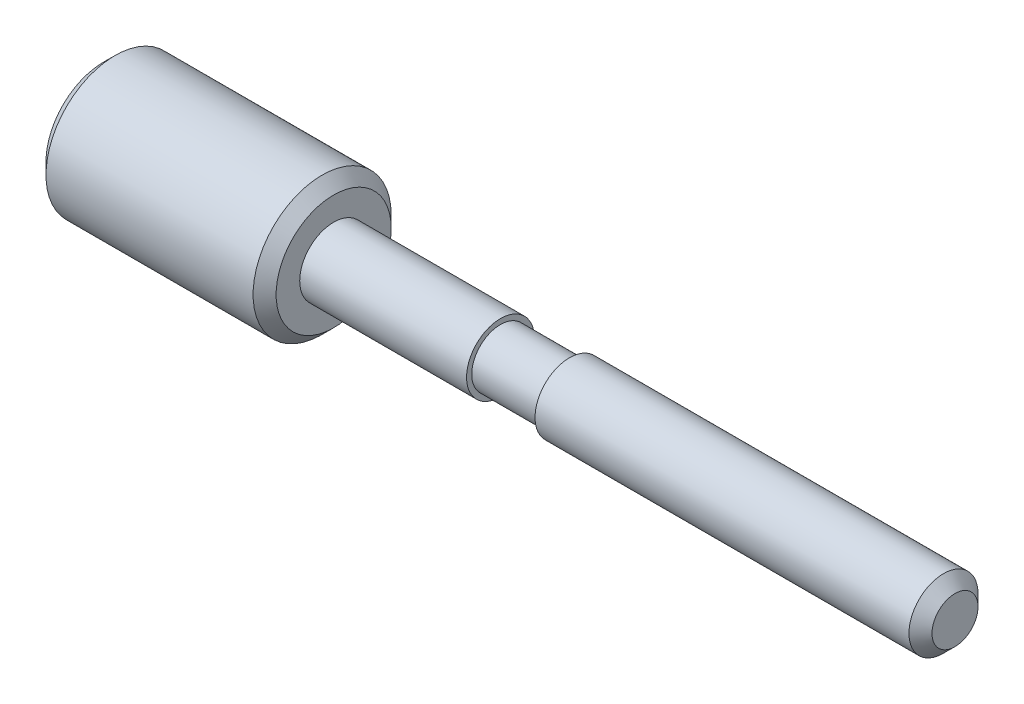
ISO-10303-21;
HEADER;
FILE_DESCRIPTION(('STEP AP214'),'2;1');
FILE_NAME('part.step','',(''),(''),'','','');
FILE_SCHEMA(('AUTOMOTIVE_DESIGN { 1 0 10303 214 1 1 1 1 }'));
ENDSEC;
DATA;
#1=APPLICATION_CONTEXT('core data for automotive mechanical design processes');
#2=APPLICATION_PROTOCOL_DEFINITION('international standard','automotive_design',2000,#1);
#3=PRODUCT_CONTEXT('',#1,'mechanical');
#4=PRODUCT('Part','Part','',(#3));
#5=PRODUCT_RELATED_PRODUCT_CATEGORY('part','',(#4));
#6=PRODUCT_DEFINITION_FORMATION('','',#4);
#7=PRODUCT_DEFINITION_CONTEXT('part definition',#1,'design');
#8=PRODUCT_DEFINITION('design','',#6,#7);
#9=PRODUCT_DEFINITION_SHAPE('','',#8);
#10=(LENGTH_UNIT() NAMED_UNIT(*) SI_UNIT(.MILLI.,.METRE.));
#11=(NAMED_UNIT(*) PLANE_ANGLE_UNIT() SI_UNIT($,.RADIAN.));
#12=(NAMED_UNIT(*) SI_UNIT($,.STERADIAN.) SOLID_ANGLE_UNIT());
#13=UNCERTAINTY_MEASURE_WITH_UNIT(LENGTH_MEASURE(1.E-05),#10,'distance_accuracy_value','');
#14=(GEOMETRIC_REPRESENTATION_CONTEXT(3) GLOBAL_UNCERTAINTY_ASSIGNED_CONTEXT((#13)) GLOBAL_UNIT_ASSIGNED_CONTEXT((#10,
#11,#12)) REPRESENTATION_CONTEXT('',''));
#15=CARTESIAN_POINT('',(0.,0.,0.));
#16=DIRECTION('',(0.,0.,1.));
#17=DIRECTION('',(1.,0.,0.));
#18=AXIS2_PLACEMENT_3D('',#15,#16,#17);
#19=CARTESIAN_POINT('',(34.5,0.,0.));
#20=DIRECTION('',(1.,0.,0.));
#21=DIRECTION('',(0.,0.,-1.));
#22=AXIS2_PLACEMENT_3D('',#19,#20,#21);
#23=PLANE('',#22);
#24=CARTESIAN_POINT('',(34.5,0.,0.));
#25=DIRECTION('',(1.,0.,0.));
#26=DIRECTION('',(0.,0.,-1.));
#27=AXIS2_PLACEMENT_3D('',#24,#25,#26);
#28=CIRCLE('',#27,2.95);
#29=CARTESIAN_POINT('',(34.5,0.,2.95));
#30=VERTEX_POINT('',#29);
#31=EDGE_CURVE('E53',#30,#30,#28,.T.);
#32=ORIENTED_EDGE('',*,*,#31,.T.);
#33=EDGE_LOOP('',(#32));
#34=FACE_BOUND('',#33,.T.);
#35=CARTESIAN_POINT('',(34.5,0.,0.));
#36=DIRECTION('',(1.,0.,0.));
#37=DIRECTION('',(0.,0.,-1.));
#38=AXIS2_PLACEMENT_3D('',#35,#36,#37);
#39=CIRCLE('',#38,2.5);
#40=CARTESIAN_POINT('',(34.5,0.,-2.5));
#41=VERTEX_POINT('',#40);
#42=EDGE_CURVE('E62',#41,#41,#39,.T.);
#43=ORIENTED_EDGE('',*,*,#42,.F.);
#44=EDGE_LOOP('',(#43));
#45=FACE_BOUND('',#44,.T.);
#46=ADVANCED_FACE('F27',(#34,#45),#23,.T.);
#47=CARTESIAN_POINT('',(20.,0.,0.));
#48=DIRECTION('',(1.,0.,0.));
#49=DIRECTION('',(0.,0.,-1.));
#50=AXIS2_PLACEMENT_3D('',#47,#48,#49);
#51=PLANE('',#50);
#52=CARTESIAN_POINT('',(20.,0.,0.));
#53=DIRECTION('',(1.,0.,0.));
#54=DIRECTION('',(0.,0.,-1.));
#55=AXIS2_PLACEMENT_3D('',#52,#53,#54);
#56=CIRCLE('',#55,4.99999999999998);
#57=CARTESIAN_POINT('',(20.,0.,-4.99999999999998));
#58=VERTEX_POINT('',#57);
#59=EDGE_CURVE('E38',#58,#58,#56,.T.);
#60=ORIENTED_EDGE('',*,*,#59,.T.);
#61=EDGE_LOOP('',(#60));
#62=FACE_BOUND('',#61,.T.);
#63=CARTESIAN_POINT('',(20.,0.,0.));
#64=DIRECTION('',(1.,0.,0.));
#65=DIRECTION('',(0.,0.,-1.));
#66=AXIS2_PLACEMENT_3D('',#63,#64,#65);
#67=CIRCLE('',#66,2.95);
#68=CARTESIAN_POINT('',(20.,0.,2.95));
#69=VERTEX_POINT('',#68);
#70=EDGE_CURVE('E56',#69,#69,#67,.T.);
#71=ORIENTED_EDGE('',*,*,#70,.F.);
#72=EDGE_LOOP('',(#71));
#73=FACE_BOUND('',#72,.T.);
#74=ADVANCED_FACE('F85',(#62,#73),#51,.T.);
#75=CARTESIAN_POINT('',(20.,0.,0.));
#76=DIRECTION('',(-1.,0.,0.));
#77=DIRECTION('',(0.,0.,1.));
#78=AXIS2_PLACEMENT_3D('',#75,#76,#77);
#79=CYLINDRICAL_SURFACE('',#78,6.);
#80=CARTESIAN_POINT('',(1.,0.,0.));
#81=DIRECTION('',(1.,0.,0.));
#82=DIRECTION('',(0.,0.,-1.));
#83=AXIS2_PLACEMENT_3D('',#80,#81,#82);
#84=CIRCLE('',#83,6.);
#85=CARTESIAN_POINT('',(1.,0.,-6.));
#86=VERTEX_POINT('',#85);
#87=EDGE_CURVE('E47',#86,#86,#84,.T.);
#88=ORIENTED_EDGE('',*,*,#87,.T.);
#89=EDGE_LOOP('',(#88));
#90=FACE_BOUND('',#89,.T.);
#91=CARTESIAN_POINT('',(19.,0.,0.));
#92=DIRECTION('',(1.,0.,0.));
#93=DIRECTION('',(0.,0.,-1.));
#94=AXIS2_PLACEMENT_3D('',#91,#92,#93);
#95=CIRCLE('',#94,6.);
#96=CARTESIAN_POINT('',(19.,0.,-6.));
#97=VERTEX_POINT('',#96);
#98=EDGE_CURVE('E50',#97,#97,#95,.F.);
#99=ORIENTED_EDGE('',*,*,#98,.T.);
#100=EDGE_LOOP('',(#99));
#101=FACE_BOUND('',#100,.T.);
#102=ADVANCED_FACE('F29',(#90,#101),#79,.T.);
#103=CARTESIAN_POINT('',(0.,0.,0.));
#104=DIRECTION('',(1.,0.,0.));
#105=DIRECTION('',(0.,0.,-1.));
#106=AXIS2_PLACEMENT_3D('',#103,#104,#105);
#107=PLANE('',#106);
#108=CARTESIAN_POINT('',(0.,0.,0.));
#109=DIRECTION('',(1.,0.,0.));
#110=DIRECTION('',(0.,0.,-1.));
#111=AXIS2_PLACEMENT_3D('',#108,#109,#110);
#112=CIRCLE('',#111,5.);
#113=CARTESIAN_POINT('',(0.,0.,-5.));
#114=VERTEX_POINT('',#113);
#115=EDGE_CURVE('E42',#114,#114,#112,.F.);
#116=ORIENTED_EDGE('',*,*,#115,.T.);
#117=EDGE_LOOP('',(#116));
#118=FACE_BOUND('',#117,.T.);
#119=ADVANCED_FACE('F96',(#118),#107,.F.);
#120=CARTESIAN_POINT('',(34.5,0.,0.));
#121=DIRECTION('',(-1.,0.,0.));
#122=DIRECTION('',(0.,0.,1.));
#123=AXIS2_PLACEMENT_3D('',#120,#121,#122);
#124=CYLINDRICAL_SURFACE('',#123,2.95);
#125=CARTESIAN_POINT('',(34.5,0.,2.95));
#126=CARTESIAN_POINT('',(34.3489583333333,0.,2.95));
#127=CARTESIAN_POINT('',(34.1979166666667,0.,2.95));
#128=CARTESIAN_POINT('',(33.8958333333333,0.,2.95));
#129=CARTESIAN_POINT('',(33.7447916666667,0.,2.95));
#130=CARTESIAN_POINT('',(33.4427083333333,0.,2.95));
#131=CARTESIAN_POINT('',(33.2916666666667,0.,2.95));
#132=CARTESIAN_POINT('',(32.9895833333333,0.,2.95));
#133=CARTESIAN_POINT('',(32.8385416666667,0.,2.95));
#134=CARTESIAN_POINT('',(32.5364583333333,0.,2.95));
#135=CARTESIAN_POINT('',(32.3854166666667,0.,2.95));
#136=CARTESIAN_POINT('',(32.0833333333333,0.,2.95));
#137=CARTESIAN_POINT('',(31.9322916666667,0.,2.95));
#138=CARTESIAN_POINT('',(31.6302083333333,0.,2.95));
#139=CARTESIAN_POINT('',(31.4791666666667,0.,2.95));
#140=CARTESIAN_POINT('',(31.1770833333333,0.,2.95));
#141=CARTESIAN_POINT('',(31.0260416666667,0.,2.95));
#142=CARTESIAN_POINT('',(30.7239583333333,0.,2.95));
#143=CARTESIAN_POINT('',(30.5729166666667,0.,2.95));
#144=CARTESIAN_POINT('',(30.2708333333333,0.,2.95));
#145=CARTESIAN_POINT('',(30.1197916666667,0.,2.95));
#146=CARTESIAN_POINT('',(29.8177083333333,0.,2.95));
#147=CARTESIAN_POINT('',(29.6666666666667,0.,2.95));
#148=CARTESIAN_POINT('',(29.3645833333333,0.,2.95));
#149=CARTESIAN_POINT('',(29.2135416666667,0.,2.95));
#150=CARTESIAN_POINT('',(28.9114583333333,0.,2.95));
#151=CARTESIAN_POINT('',(28.7604166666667,0.,2.95));
#152=CARTESIAN_POINT('',(28.4583333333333,0.,2.95));
#153=CARTESIAN_POINT('',(28.3072916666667,0.,2.95));
#154=CARTESIAN_POINT('',(28.0052083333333,0.,2.95));
#155=CARTESIAN_POINT('',(27.8541666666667,0.,2.95));
#156=CARTESIAN_POINT('',(27.5520833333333,0.,2.95));
#157=CARTESIAN_POINT('',(27.4010416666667,0.,2.95));
#158=CARTESIAN_POINT('',(27.0989583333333,0.,2.95));
#159=CARTESIAN_POINT('',(26.9479166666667,0.,2.95));
#160=CARTESIAN_POINT('',(26.6458333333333,0.,2.95));
#161=CARTESIAN_POINT('',(26.4947916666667,0.,2.95));
#162=CARTESIAN_POINT('',(26.1927083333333,0.,2.95));
#163=CARTESIAN_POINT('',(26.0416666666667,0.,2.95));
#164=CARTESIAN_POINT('',(25.7395833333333,0.,2.95));
#165=CARTESIAN_POINT('',(25.5885416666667,0.,2.95));
#166=CARTESIAN_POINT('',(25.2864583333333,0.,2.95));
#167=CARTESIAN_POINT('',(25.1354166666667,0.,2.95));
#168=CARTESIAN_POINT('',(24.8333333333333,0.,2.95));
#169=CARTESIAN_POINT('',(24.6822916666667,0.,2.95));
#170=CARTESIAN_POINT('',(24.3802083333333,0.,2.95));
#171=CARTESIAN_POINT('',(24.2291666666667,0.,2.95));
#172=CARTESIAN_POINT('',(23.9270833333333,0.,2.95));
#173=CARTESIAN_POINT('',(23.7760416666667,0.,2.95));
#174=CARTESIAN_POINT('',(23.4739583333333,0.,2.95));
#175=CARTESIAN_POINT('',(23.3229166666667,0.,2.95));
#176=CARTESIAN_POINT('',(23.0208333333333,0.,2.95));
#177=CARTESIAN_POINT('',(22.8697916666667,0.,2.95));
#178=CARTESIAN_POINT('',(22.5677083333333,0.,2.95));
#179=CARTESIAN_POINT('',(22.4166666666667,0.,2.95));
#180=CARTESIAN_POINT('',(22.1145833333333,0.,2.95));
#181=CARTESIAN_POINT('',(21.9635416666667,0.,2.95));
#182=CARTESIAN_POINT('',(21.6614583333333,0.,2.95));
#183=CARTESIAN_POINT('',(21.5104166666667,0.,2.95));
#184=CARTESIAN_POINT('',(21.2083333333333,0.,2.95));
#185=CARTESIAN_POINT('',(21.0572916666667,0.,2.95));
#186=CARTESIAN_POINT('',(20.7552083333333,0.,2.95));
#187=CARTESIAN_POINT('',(20.6041666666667,0.,2.95));
#188=CARTESIAN_POINT('',(20.3020833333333,0.,2.95));
#189=CARTESIAN_POINT('',(20.1510416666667,0.,2.95));
#190=CARTESIAN_POINT('',(20.,0.,2.95));
#191=B_SPLINE_CURVE_WITH_KNOTS('',3,(#125,#126,#127,#128,#129,#130,#131,#132,#133,#134,#135,
#136,#137,#138,#139,#140,#141,#142,#143,#144,#145,#146,#147,#148,#149,#150,#151,#152,#153,#154,
#155,#156,#157,#158,#159,#160,#161,#162,#163,#164,#165,#166,#167,#168,#169,#170,#171,#172,#173,
#174,#175,#176,#177,#178,#179,#180,#181,#182,#183,#184,#185,#186,#187,#188,#189,#190),
.UNSPECIFIED.,.F.,.F.,(4,2,2,2,2,2,2,2,2,2,2,2,2,2,2,2,2,2,2,2,2,2,2,2,2,2,2,2,2,2,2,2,4),(0.,
0.453124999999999,0.906249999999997,1.359375,1.81249999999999,2.26562499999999,2.71875,3.171875,
3.625,4.07812499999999,4.53125,4.984375,5.4375,5.890625,6.34375,6.796875,7.25,7.703125,8.15625,
8.60937499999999,9.06249999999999,9.515625,9.96875,10.421875,10.875,11.328125,11.78125,
12.234375,12.6875,13.140625,13.59375,14.046875,14.5),.UNSPECIFIED.);
#192=EDGE_CURVE('BSEAM80',#30,#69,#191,.T.);
#193=ORIENTED_EDGE('',*,*,#31,.F.);
#194=ORIENTED_EDGE('',*,*,#70,.T.);
#195=ORIENTED_EDGE('',*,*,#192,.T.);
#196=ORIENTED_EDGE('',*,*,#192,.F.);
#197=EDGE_LOOP('',(#193,#195,#194,#196));
#198=FACE_BOUND('',#197,.T.);
#199=ADVANCED_FACE('F80',(#198),#124,.T.);
#200=CARTESIAN_POINT('',(40.5,0.,0.));
#201=DIRECTION('',(-1.,0.,0.));
#202=DIRECTION('',(0.,0.,1.));
#203=AXIS2_PLACEMENT_3D('',#200,#201,#202);
#204=CYLINDRICAL_SURFACE('',#203,2.5);
#205=CARTESIAN_POINT('',(40.5,0.,0.));
#206=DIRECTION('',(1.,0.,0.));
#207=DIRECTION('',(0.,0.,-1.));
#208=AXIS2_PLACEMENT_3D('',#205,#206,#207);
#209=CIRCLE('',#208,2.5);
#210=CARTESIAN_POINT('',(40.5,0.,-2.5));
#211=VERTEX_POINT('',#210);
#212=EDGE_CURVE('E59',#211,#211,#209,.T.);
#213=ORIENTED_EDGE('',*,*,#212,.F.);
#214=EDGE_LOOP('',(#213));
#215=FACE_BOUND('',#214,.T.);
#216=ORIENTED_EDGE('',*,*,#42,.T.);
#217=EDGE_LOOP('',(#216));
#218=FACE_BOUND('',#217,.T.);
#219=ADVANCED_FACE('F74',(#215,#218),#204,.T.);
#220=CARTESIAN_POINT('',(40.5,0.,0.));
#221=DIRECTION('',(1.,0.,0.));
#222=DIRECTION('',(0.,0.,-1.));
#223=AXIS2_PLACEMENT_3D('',#220,#221,#222);
#224=PLANE('',#223);
#225=CARTESIAN_POINT('',(40.5,0.,0.));
#226=DIRECTION('',(1.,0.,0.));
#227=DIRECTION('',(0.,0.,-1.));
#228=AXIS2_PLACEMENT_3D('',#225,#226,#227);
#229=CIRCLE('',#228,3.);
#230=CARTESIAN_POINT('',(40.5,0.,-3.));
#231=VERTEX_POINT('',#230);
#232=EDGE_CURVE('E65',#231,#231,#229,.T.);
#233=ORIENTED_EDGE('',*,*,#232,.F.);
#234=EDGE_LOOP('',(#233));
#235=FACE_BOUND('',#234,.T.);
#236=ORIENTED_EDGE('',*,*,#212,.T.);
#237=EDGE_LOOP('',(#236));
#238=FACE_BOUND('',#237,.T.);
#239=ADVANCED_FACE('F71',(#235,#238),#224,.F.);
#240=CARTESIAN_POINT('',(74.,0.,0.));
#241=DIRECTION('',(-1.,0.,0.));
#242=DIRECTION('',(0.,0.,1.));
#243=AXIS2_PLACEMENT_3D('',#240,#241,#242);
#244=CYLINDRICAL_SURFACE('',#243,3.);
#245=CARTESIAN_POINT('',(73.,0.,0.));
#246=DIRECTION('',(1.,0.,0.));
#247=DIRECTION('',(0.,0.,-1.));
#248=AXIS2_PLACEMENT_3D('',#245,#246,#247);
#249=CIRCLE('',#248,3.);
#250=CARTESIAN_POINT('',(73.,0.,-3.));
#251=VERTEX_POINT('',#250);
#252=EDGE_CURVE('E10',#251,#251,#249,.F.);
#253=ORIENTED_EDGE('',*,*,#252,.T.);
#254=EDGE_LOOP('',(#253));
#255=FACE_BOUND('',#254,.T.);
#256=ORIENTED_EDGE('',*,*,#232,.T.);
#257=EDGE_LOOP('',(#256));
#258=FACE_BOUND('',#257,.T.);
#259=ADVANCED_FACE('F69',(#255,#258),#244,.T.);
#260=CARTESIAN_POINT('',(74.,0.,0.));
#261=DIRECTION('',(1.,0.,0.));
#262=DIRECTION('',(0.,0.,-1.));
#263=AXIS2_PLACEMENT_3D('',#260,#261,#262);
#264=PLANE('',#263);
#265=CARTESIAN_POINT('',(74.,0.,0.));
#266=DIRECTION('',(1.,0.,0.));
#267=DIRECTION('',(0.,0.,-1.));
#268=AXIS2_PLACEMENT_3D('',#265,#266,#267);
#269=CIRCLE('',#268,1.99999999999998);
#270=CARTESIAN_POINT('',(74.,0.,-1.99999999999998));
#271=VERTEX_POINT('',#270);
#272=EDGE_CURVE('E34',#271,#271,#269,.T.);
#273=ORIENTED_EDGE('',*,*,#272,.T.);
#274=EDGE_LOOP('',(#273));
#275=FACE_BOUND('',#274,.T.);
#276=ADVANCED_FACE('F110',(#275),#264,.T.);
#277=CARTESIAN_POINT('',(1.,0.,0.));
#278=DIRECTION('',(1.,0.,0.));
#279=DIRECTION('',(0.,0.,-1.));
#280=AXIS2_PLACEMENT_3D('',#277,#278,#279);
#281=CONICAL_SURFACE('',#280,6.,0.78539816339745);
#282=ORIENTED_EDGE('',*,*,#115,.F.);
#283=EDGE_LOOP('',(#282));
#284=FACE_BOUND('',#283,.T.);
#285=ORIENTED_EDGE('',*,*,#87,.F.);
#286=EDGE_LOOP('',(#285));
#287=FACE_BOUND('',#286,.T.);
#288=ADVANCED_FACE('F106',(#284,#287),#281,.T.);
#289=CARTESIAN_POINT('',(20.,0.,0.));
#290=DIRECTION('',(-1.,0.,0.));
#291=DIRECTION('',(0.,0.,1.));
#292=AXIS2_PLACEMENT_3D('',#289,#290,#291);
#293=CONICAL_SURFACE('',#292,4.99999999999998,0.785398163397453);
#294=ORIENTED_EDGE('',*,*,#98,.F.);
#295=EDGE_LOOP('',(#294));
#296=FACE_BOUND('',#295,.T.);
#297=ORIENTED_EDGE('',*,*,#59,.F.);
#298=EDGE_LOOP('',(#297));
#299=FACE_BOUND('',#298,.T.);
#300=ADVANCED_FACE('F109',(#296,#299),#293,.T.);
#301=CARTESIAN_POINT('',(74.,0.,0.));
#302=DIRECTION('',(-1.,0.,0.));
#303=DIRECTION('',(0.,0.,1.));
#304=AXIS2_PLACEMENT_3D('',#301,#302,#303);
#305=CONICAL_SURFACE('',#304,1.99999999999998,0.785398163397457);
#306=ORIENTED_EDGE('',*,*,#252,.F.);
#307=EDGE_LOOP('',(#306));
#308=FACE_BOUND('',#307,.T.);
#309=ORIENTED_EDGE('',*,*,#272,.F.);
#310=EDGE_LOOP('',(#309));
#311=FACE_BOUND('',#310,.T.);
#312=ADVANCED_FACE('F118',(#308,#311),#305,.T.);
#313=CLOSED_SHELL('',(#46,#74,#102,#119,#199,#219,#239,#259,#276,#288,#300,#312));
#314=MANIFOLD_SOLID_BREP('B2',#313);
#315=ADVANCED_BREP_SHAPE_REPRESENTATION('',(#18,#314),#14);
#316=SHAPE_DEFINITION_REPRESENTATION(#9,#315);
ENDSEC;
END-ISO-10303-21;
